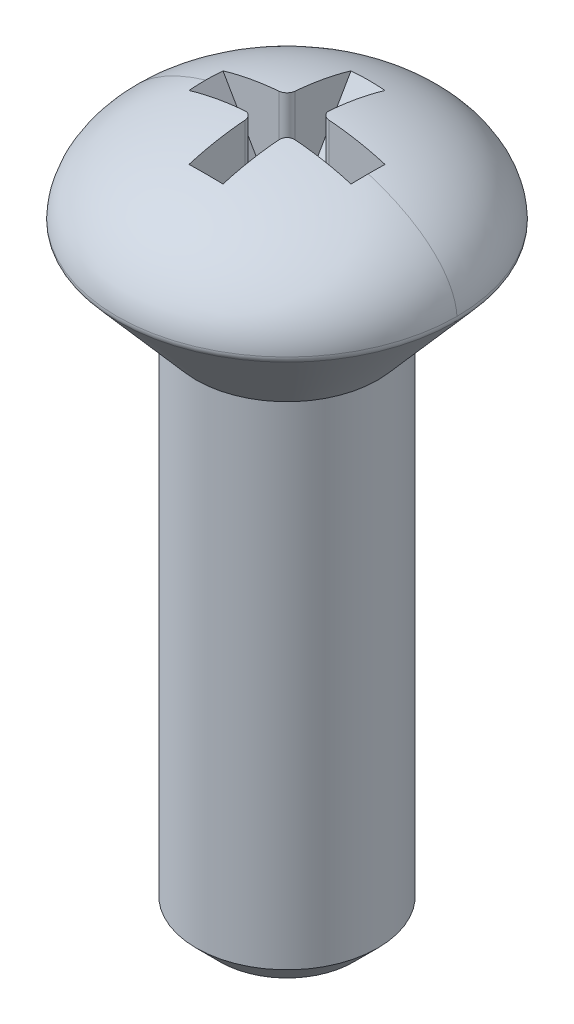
ISO-10303-21;
HEADER;
FILE_DESCRIPTION(('STEP AP214'),'2;1');
FILE_NAME('part.step','',(''),(''),'','','');
FILE_SCHEMA(('AUTOMOTIVE_DESIGN { 1 0 10303 214 1 1 1 1 }'));
ENDSEC;
DATA;
#1=APPLICATION_CONTEXT('core data for automotive mechanical design processes');
#2=APPLICATION_PROTOCOL_DEFINITION('international standard','automotive_design',2000,#1);
#3=PRODUCT_CONTEXT('',#1,'mechanical');
#4=PRODUCT('Part','Part','',(#3));
#5=PRODUCT_RELATED_PRODUCT_CATEGORY('part','',(#4));
#6=PRODUCT_DEFINITION_FORMATION('','',#4);
#7=PRODUCT_DEFINITION_CONTEXT('part definition',#1,'design');
#8=PRODUCT_DEFINITION('design','',#6,#7);
#9=PRODUCT_DEFINITION_SHAPE('','',#8);
#10=(LENGTH_UNIT() NAMED_UNIT(*) SI_UNIT(.MILLI.,.METRE.));
#11=(NAMED_UNIT(*) PLANE_ANGLE_UNIT() SI_UNIT($,.RADIAN.));
#12=(NAMED_UNIT(*) SI_UNIT($,.STERADIAN.) SOLID_ANGLE_UNIT());
#13=UNCERTAINTY_MEASURE_WITH_UNIT(LENGTH_MEASURE(1.E-05),#10,'distance_accuracy_value','');
#14=(GEOMETRIC_REPRESENTATION_CONTEXT(3) GLOBAL_UNCERTAINTY_ASSIGNED_CONTEXT((#13)) GLOBAL_UNIT_ASSIGNED_CONTEXT((#10,
#11,#12)) REPRESENTATION_CONTEXT('',''));
#15=CARTESIAN_POINT('',(0.,0.,0.));
#16=DIRECTION('',(0.,0.,1.));
#17=DIRECTION('',(1.,0.,0.));
#18=AXIS2_PLACEMENT_3D('',#15,#16,#17);
#19=CARTESIAN_POINT('',(0.2667,0.2032,0.2667));
#20=DIRECTION('',(0.,1.,0.));
#21=DIRECTION('',(0.,0.,1.));
#22=AXIS2_PLACEMENT_3D('',#19,#20,#21);
#23=PLANE('',#22);
#24=DIRECTION('',(0.,0.,1.));
#25=VECTOR('',#24,1.);
#26=CARTESIAN_POINT('',(-0.2667,0.2032,1.27));
#27=LINE('',#26,#25);
#28=CARTESIAN_POINT('',(-0.2667,0.2032,0.393700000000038));
#29=VERTEX_POINT('',#28);
#30=CARTESIAN_POINT('',(-0.2667,0.2032,0.644243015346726));
#31=VERTEX_POINT('',#30);
#32=EDGE_CURVE('E182',#29,#31,#27,.T.);
#33=ORIENTED_EDGE('',*,*,#32,.T.);
#34=DIRECTION('',(1.,0.,0.));
#35=VECTOR('',#34,1.);
#36=CARTESIAN_POINT('',(0.,0.2032,0.644243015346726));
#37=LINE('',#36,#35);
#38=CARTESIAN_POINT('',(0.2667,0.2032,0.644243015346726));
#39=VERTEX_POINT('',#38);
#40=EDGE_CURVE('E188',#39,#31,#37,.F.);
#41=ORIENTED_EDGE('',*,*,#40,.F.);
#42=DIRECTION('',(0.,0.,-1.));
#43=VECTOR('',#42,1.);
#44=CARTESIAN_POINT('',(0.2667,0.2032,1.27));
#45=LINE('',#44,#43);
#46=CARTESIAN_POINT('',(0.2667,0.2032,0.3937));
#47=VERTEX_POINT('',#46);
#48=EDGE_CURVE('E193',#39,#47,#45,.T.);
#49=ORIENTED_EDGE('',*,*,#48,.T.);
#50=CARTESIAN_POINT('',(0.3937,0.2032,0.3937));
#51=DIRECTION('',(0.,1.,0.));
#52=DIRECTION('',(0.,0.,1.));
#53=AXIS2_PLACEMENT_3D('',#50,#51,#52);
#54=CIRCLE('',#53,0.127);
#55=CARTESIAN_POINT('',(0.393700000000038,0.2032,0.2667));
#56=VERTEX_POINT('',#55);
#57=EDGE_CURVE('E202',#56,#47,#54,.T.);
#58=ORIENTED_EDGE('',*,*,#57,.F.);
#59=DIRECTION('',(1.,0.,0.));
#60=VECTOR('',#59,1.);
#61=CARTESIAN_POINT('',(1.27,0.2032,0.2667));
#62=LINE('',#61,#60);
#63=CARTESIAN_POINT('',(0.644243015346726,0.2032,0.2667));
#64=VERTEX_POINT('',#63);
#65=EDGE_CURVE('E199',#56,#64,#62,.T.);
#66=ORIENTED_EDGE('',*,*,#65,.T.);
#67=DIRECTION('',(0.,0.,1.));
#68=VECTOR('',#67,1.);
#69=CARTESIAN_POINT('',(0.644243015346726,0.2032,0.));
#70=LINE('',#69,#68);
#71=CARTESIAN_POINT('',(0.644243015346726,0.2032,-0.2667));
#72=VERTEX_POINT('',#71);
#73=EDGE_CURVE('E206',#72,#64,#70,.T.);
#74=ORIENTED_EDGE('',*,*,#73,.F.);
#75=DIRECTION('',(-1.,0.,0.));
#76=VECTOR('',#75,1.);
#77=CARTESIAN_POINT('',(1.27,0.2032,-0.2667));
#78=LINE('',#77,#76);
#79=CARTESIAN_POINT('',(0.3937,0.2032,-0.2667));
#80=VERTEX_POINT('',#79);
#81=EDGE_CURVE('E211',#72,#80,#78,.T.);
#82=ORIENTED_EDGE('',*,*,#81,.T.);
#83=CARTESIAN_POINT('',(0.3937,0.2032,-0.3937));
#84=DIRECTION('',(0.,1.,0.));
#85=DIRECTION('',(0.,0.,1.));
#86=AXIS2_PLACEMENT_3D('',#83,#84,#85);
#87=CIRCLE('',#86,0.127);
#88=CARTESIAN_POINT('',(0.2667,0.2032,-0.393700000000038));
#89=VERTEX_POINT('',#88);
#90=EDGE_CURVE('E219',#89,#80,#87,.T.);
#91=ORIENTED_EDGE('',*,*,#90,.F.);
#92=DIRECTION('',(0.,0.,-1.));
#93=VECTOR('',#92,1.);
#94=CARTESIAN_POINT('',(0.2667,0.2032,-0.2667));
#95=LINE('',#94,#93);
#96=CARTESIAN_POINT('',(0.2667,0.2032,-0.644243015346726));
#97=VERTEX_POINT('',#96);
#98=EDGE_CURVE('E217',#89,#97,#95,.T.);
#99=ORIENTED_EDGE('',*,*,#98,.T.);
#100=DIRECTION('',(1.,0.,0.));
#101=VECTOR('',#100,1.);
#102=CARTESIAN_POINT('',(0.,0.2032,-0.644243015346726));
#103=LINE('',#102,#101);
#104=CARTESIAN_POINT('',(-0.2667,0.2032,-0.644243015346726));
#105=VERTEX_POINT('',#104);
#106=EDGE_CURVE('E143',#105,#97,#103,.T.);
#107=ORIENTED_EDGE('',*,*,#106,.F.);
#108=DIRECTION('',(0.,0.,1.));
#109=VECTOR('',#108,1.);
#110=CARTESIAN_POINT('',(-0.2667,0.2032,-0.2667));
#111=LINE('',#110,#109);
#112=CARTESIAN_POINT('',(-0.2667,0.2032,-0.3937));
#113=VERTEX_POINT('',#112);
#114=EDGE_CURVE('E140',#105,#113,#111,.T.);
#115=ORIENTED_EDGE('',*,*,#114,.T.);
#116=CARTESIAN_POINT('',(-0.3937,0.2032,-0.3937));
#117=DIRECTION('',(0.,1.,0.));
#118=DIRECTION('',(0.,0.,1.));
#119=AXIS2_PLACEMENT_3D('',#116,#117,#118);
#120=CIRCLE('',#119,0.127);
#121=CARTESIAN_POINT('',(-0.393700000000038,0.2032,-0.2667));
#122=VERTEX_POINT('',#121);
#123=EDGE_CURVE('E20',#122,#113,#120,.T.);
#124=ORIENTED_EDGE('',*,*,#123,.F.);
#125=DIRECTION('',(-1.,0.,0.));
#126=VECTOR('',#125,1.);
#127=CARTESIAN_POINT('',(-0.2667,0.2032,-0.2667));
#128=LINE('',#127,#126);
#129=CARTESIAN_POINT('',(-0.644243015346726,0.2032,-0.2667));
#130=VERTEX_POINT('',#129);
#131=EDGE_CURVE('E155',#122,#130,#128,.T.);
#132=ORIENTED_EDGE('',*,*,#131,.T.);
#133=DIRECTION('',(0.,0.,1.));
#134=VECTOR('',#133,1.);
#135=CARTESIAN_POINT('',(-0.644243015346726,0.2032,0.));
#136=LINE('',#135,#134);
#137=CARTESIAN_POINT('',(-0.644243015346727,0.2032,0.2667));
#138=VERTEX_POINT('',#137);
#139=EDGE_CURVE('E169',#138,#130,#136,.F.);
#140=ORIENTED_EDGE('',*,*,#139,.F.);
#141=DIRECTION('',(1.,0.,0.));
#142=VECTOR('',#141,1.);
#143=CARTESIAN_POINT('',(-0.2667,0.2032,0.2667));
#144=LINE('',#143,#142);
#145=CARTESIAN_POINT('',(-0.3937,0.2032,0.2667));
#146=VERTEX_POINT('',#145);
#147=EDGE_CURVE('E176',#138,#146,#144,.T.);
#148=ORIENTED_EDGE('',*,*,#147,.T.);
#149=CARTESIAN_POINT('',(-0.3937,0.2032,0.3937));
#150=DIRECTION('',(0.,1.,0.));
#151=DIRECTION('',(0.,0.,1.));
#152=AXIS2_PLACEMENT_3D('',#149,#150,#151);
#153=CIRCLE('',#152,0.127);
#154=EDGE_CURVE('E184',#29,#146,#153,.T.);
#155=ORIENTED_EDGE('',*,*,#154,.F.);
#156=EDGE_LOOP('',(#33,#41,#49,#58,#66,#74,#82,#91,#99,#107,#115,#124,#132,#140,#148,#155));
#157=FACE_BOUND('',#156,.T.);
#158=ADVANCED_FACE('F17',(#157),#23,.T.);
#159=CARTESIAN_POINT('',(-0.2667,0.2032,-0.2667));
#160=DIRECTION('',(0.,0.,-1.));
#161=DIRECTION('',(-1.,0.,0.));
#162=AXIS2_PLACEMENT_3D('',#159,#160,#161);
#163=PLANE('',#162);
#164=DIRECTION('',(0.,1.,0.));
#165=VECTOR('',#164,1.);
#166=CARTESIAN_POINT('',(-0.393700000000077,0.2032,-0.2667));
#167=LINE('',#166,#165);
#168=CARTESIAN_POINT('',(-0.393700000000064,1.44959332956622,-0.2667));
#169=VERTEX_POINT('',#168);
#170=EDGE_CURVE('E148',#169,#122,#167,.F.);
#171=ORIENTED_EDGE('',*,*,#170,.F.);
#172=CARTESIAN_POINT('',(-1.27,1.28704289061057,-0.2667));
#173=CARTESIAN_POINT('',(-1.22239924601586,1.30137106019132,-0.2667));
#174=CARTESIAN_POINT('',(-1.17451613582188,1.31474655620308,-0.2667));
#175=CARTESIAN_POINT('',(-1.07839618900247,1.33963942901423,-0.2667));
#176=CARTESIAN_POINT('',(-1.03016053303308,1.35116135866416,-0.2667));
#177=CARTESIAN_POINT('',(-0.933363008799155,1.37245294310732,-0.2667));
#178=CARTESIAN_POINT('',(-0.884801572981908,1.38222457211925,-0.266700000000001));
#179=CARTESIAN_POINT('',(-0.787378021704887,1.40009014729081,-0.2667));
#180=CARTESIAN_POINT('',(-0.738515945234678,1.4081843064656,-0.266699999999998));
#181=CARTESIAN_POINT('',(-0.640488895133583,1.42275519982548,-0.266700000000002));
#182=CARTESIAN_POINT('',(-0.591323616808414,1.42922987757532,-0.266700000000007));
#183=CARTESIAN_POINT('',(-0.492693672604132,1.44059767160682,-0.266699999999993));
#184=CARTESIAN_POINT('',(-0.443228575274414,1.44548704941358,-0.266699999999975));
#185=CARTESIAN_POINT('',(-0.393700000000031,1.44959332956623,-0.26669999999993));
#186=B_SPLINE_CURVE_WITH_KNOTS('',3,(#172,#173,#174,#175,#176,#177,#178,#179,#180,#181,#182,
#183,#184,#185),.UNSPECIFIED.,.F.,.F.,(4,2,2,2,2,2,4),(0.,0.149115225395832,0.297858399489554,
0.446432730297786,0.594988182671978,0.74373132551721,0.892822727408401),.UNSPECIFIED.);
#187=CARTESIAN_POINT('',(-1.27,1.28704289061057,-0.2667));
#188=VERTEX_POINT('',#187);
#189=EDGE_CURVE('E273',#188,#169,#186,.T.);
#190=ORIENTED_EDGE('',*,*,#189,.F.);
#191=DIRECTION('',(-0.500000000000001,0.866025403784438,0.));
#192=VECTOR('',#191,1.);
#193=CARTESIAN_POINT('',(-1.27,1.28704289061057,-0.2667));
#194=LINE('',#193,#192);
#195=EDGE_CURVE('E172',#130,#188,#194,.T.);
#196=ORIENTED_EDGE('',*,*,#195,.F.);
#197=ORIENTED_EDGE('',*,*,#131,.F.);
#198=EDGE_LOOP('',(#171,#190,#196,#197));
#199=FACE_BOUND('',#198,.T.);
#200=ADVANCED_FACE('F335',(#199),#163,.F.);
#201=CARTESIAN_POINT('',(-0.3937,0.2032,-0.3937));
#202=DIRECTION('',(0.,1.,0.));
#203=DIRECTION('',(0.,0.,1.));
#204=AXIS2_PLACEMENT_3D('',#201,#202,#203);
#205=CYLINDRICAL_SURFACE('',#204,0.127);
#206=CARTESIAN_POINT('',(-0.393700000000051,1.44959332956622,-0.2667));
#207=CARTESIAN_POINT('',(-0.386583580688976,1.45018303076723,-0.266700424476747));
#208=CARTESIAN_POINT('',(-0.379475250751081,1.45072206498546,-0.267299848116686));
#209=CARTESIAN_POINT('',(-0.365454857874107,1.45168595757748,-0.269675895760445));
#210=CARTESIAN_POINT('',(-0.358542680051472,1.45211088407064,-0.271451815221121));
#211=CARTESIAN_POINT('',(-0.338398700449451,1.45319401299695,-0.278499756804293));
#212=CARTESIAN_POINT('',(-0.325713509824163,1.45366434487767,-0.285492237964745));
#213=CARTESIAN_POINT('',(-0.303428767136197,1.45403955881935,-0.303235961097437));
#214=CARTESIAN_POINT('',(-0.293817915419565,1.45394653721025,-0.313973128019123));
#215=CARTESIAN_POINT('',(-0.278698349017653,1.45321058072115,-0.337997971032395));
#216=CARTESIAN_POINT('',(-0.273183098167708,1.45256852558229,-0.351281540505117));
#217=CARTESIAN_POINT('',(-0.267780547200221,1.4510975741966,-0.374459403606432));
#218=CARTESIAN_POINT('',(-0.266661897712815,1.45039284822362,-0.384089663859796));
#219=CARTESIAN_POINT('',(-0.2667,1.44959332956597,-0.393700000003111));
#220=B_SPLINE_CURVE_WITH_KNOTS('',3,(#206,#207,#208,#209,#210,#211,#212,#213,#214,#215,#216,
#217,#218,#219),.UNSPECIFIED.,.F.,.F.,(4,2,2,2,2,2,4),(0.,0.0213729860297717,0.0427331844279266,
0.0853220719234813,0.127752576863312,0.17011522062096,0.199018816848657),.UNSPECIFIED.);
#221=CARTESIAN_POINT('',(-0.2667,1.44959332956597,-0.393700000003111));
#222=VERTEX_POINT('',#221);
#223=EDGE_CURVE('E311',#169,#222,#220,.T.);
#224=ORIENTED_EDGE('',*,*,#223,.F.);
#225=ORIENTED_EDGE('',*,*,#170,.T.);
#226=ORIENTED_EDGE('',*,*,#123,.T.);
#227=DIRECTION('',(0.,1.,0.));
#228=VECTOR('',#227,1.);
#229=CARTESIAN_POINT('',(-0.2667,0.2032,-0.3937));
#230=LINE('',#229,#228);
#231=EDGE_CURVE('E147',#113,#222,#230,.T.);
#232=ORIENTED_EDGE('',*,*,#231,.T.);
#233=EDGE_LOOP('',(#224,#225,#226,#232));
#234=FACE_BOUND('',#233,.T.);
#235=ADVANCED_FACE('F153',(#234),#205,.T.);
#236=CARTESIAN_POINT('',(-0.2667,0.2032,-0.2667));
#237=DIRECTION('',(-1.,0.,0.));
#238=DIRECTION('',(0.,0.,1.));
#239=AXIS2_PLACEMENT_3D('',#236,#237,#238);
#240=PLANE('',#239);
#241=ORIENTED_EDGE('',*,*,#231,.F.);
#242=ORIENTED_EDGE('',*,*,#114,.F.);
#243=DIRECTION('',(0.,-0.866025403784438,0.500000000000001));
#244=VECTOR('',#243,1.);
#245=CARTESIAN_POINT('',(-0.2667,1.28704289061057,-1.27));
#246=LINE('',#245,#244);
#247=CARTESIAN_POINT('',(-0.2667,1.28704289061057,-1.27));
#248=VERTEX_POINT('',#247);
#249=EDGE_CURVE('E160',#248,#105,#246,.T.);
#250=ORIENTED_EDGE('',*,*,#249,.F.);
#251=CARTESIAN_POINT('',(-0.2667,1.44959332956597,-0.393700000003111));
#252=CARTESIAN_POINT('',(-0.2667,1.44548704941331,-0.443228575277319));
#253=CARTESIAN_POINT('',(-0.2667,1.44059767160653,-0.492693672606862));
#254=CARTESIAN_POINT('',(-0.2667,1.42922987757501,-0.591323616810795));
#255=CARTESIAN_POINT('',(-0.2667,1.42275519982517,-0.640488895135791));
#256=CARTESIAN_POINT('',(-0.2667,1.4081843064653,-0.73851594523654));
#257=CARTESIAN_POINT('',(-0.2667,1.40009014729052,-0.787378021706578));
#258=CARTESIAN_POINT('',(-0.2667,1.38222457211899,-0.884801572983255));
#259=CARTESIAN_POINT('',(-0.2667,1.37245294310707,-0.933363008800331));
#260=CARTESIAN_POINT('',(-0.2667,1.35116135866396,-1.03016053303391));
#261=CARTESIAN_POINT('',(-0.2667,1.33963942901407,-1.07839618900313));
#262=CARTESIAN_POINT('',(-0.2667,1.31474655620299,-1.17451613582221));
#263=CARTESIAN_POINT('',(-0.2667,1.30137106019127,-1.22239924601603));
#264=CARTESIAN_POINT('',(-0.266699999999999,1.28704289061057,-1.27));
#265=B_SPLINE_CURVE_WITH_KNOTS('',3,(#251,#252,#253,#254,#255,#256,#257,#258,#259,#260,#261,
#262,#263,#264),.UNSPECIFIED.,.F.,.F.,(4,2,2,2,2,2,4),(0.,0.149091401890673,0.29783454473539,
0.446389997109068,0.594964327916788,0.743707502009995,0.892822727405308),.UNSPECIFIED.);
#266=EDGE_CURVE('E158',#222,#248,#265,.T.);
#267=ORIENTED_EDGE('',*,*,#266,.F.);
#268=EDGE_LOOP('',(#241,#242,#250,#267));
#269=FACE_BOUND('',#268,.T.);
#270=ADVANCED_FACE('F156',(#269),#240,.F.);
#271=CARTESIAN_POINT('',(0.,1.28704289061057,-1.27));
#272=DIRECTION('',(0.,0.500000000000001,0.866025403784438));
#273=DIRECTION('',(0.,-0.866025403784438,0.500000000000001));
#274=AXIS2_PLACEMENT_3D('',#271,#272,#273);
#275=PLANE('',#274);
#276=ORIENTED_EDGE('',*,*,#106,.T.);
#277=DIRECTION('',(0.,0.866025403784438,-0.500000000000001));
#278=VECTOR('',#277,1.);
#279=CARTESIAN_POINT('',(0.2667,0.2032,-0.644243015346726));
#280=LINE('',#279,#278);
#281=CARTESIAN_POINT('',(0.2667,1.28704289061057,-1.27));
#282=VERTEX_POINT('',#281);
#283=EDGE_CURVE('E220',#97,#282,#280,.T.);
#284=ORIENTED_EDGE('',*,*,#283,.T.);
#285=CARTESIAN_POINT('',(-0.2667,1.28704289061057,-1.27));
#286=CARTESIAN_POINT('',(-0.177799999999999,1.29181895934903,-1.27275746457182));
#287=CARTESIAN_POINT('',(-0.088899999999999,1.29420699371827,-1.27413619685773));
#288=CARTESIAN_POINT('',(0.0889000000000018,1.29420699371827,-1.27413619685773));
#289=CARTESIAN_POINT('',(0.177800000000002,1.29181895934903,-1.27275746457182));
#290=CARTESIAN_POINT('',(0.266700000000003,1.28704289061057,-1.27));
#291=B_SPLINE_CURVE_WITH_KNOTS('',3,(#285,#286,#287,#288,#289,#290),.UNSPECIFIED.,.F.,.F.,(4,2,
4),(0.,0.266828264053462,0.533656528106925),.UNSPECIFIED.);
#292=EDGE_CURVE('E301',#248,#282,#291,.T.);
#293=ORIENTED_EDGE('',*,*,#292,.F.);
#294=ORIENTED_EDGE('',*,*,#249,.T.);
#295=EDGE_LOOP('',(#276,#284,#293,#294));
#296=FACE_BOUND('',#295,.T.);
#297=ADVANCED_FACE('F299',(#296),#275,.T.);
#298=CARTESIAN_POINT('',(0.2667,0.2032,-0.2667));
#299=DIRECTION('',(1.,0.,0.));
#300=DIRECTION('',(0.,0.,-1.));
#301=AXIS2_PLACEMENT_3D('',#298,#299,#300);
#302=PLANE('',#301);
#303=DIRECTION('',(0.,1.,0.));
#304=VECTOR('',#303,1.);
#305=CARTESIAN_POINT('',(0.2667,0.2032,-0.393700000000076));
#306=LINE('',#305,#304);
#307=CARTESIAN_POINT('',(0.2667,1.44959332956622,-0.393700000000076));
#308=VERTEX_POINT('',#307);
#309=EDGE_CURVE('E214',#308,#89,#306,.F.);
#310=ORIENTED_EDGE('',*,*,#309,.F.);
#311=CARTESIAN_POINT('',(0.2667,1.28704289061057,-1.27));
#312=CARTESIAN_POINT('',(0.2667,1.30137106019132,-1.22239924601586));
#313=CARTESIAN_POINT('',(0.2667,1.31474655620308,-1.17451613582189));
#314=CARTESIAN_POINT('',(0.2667,1.33963942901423,-1.07839618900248));
#315=CARTESIAN_POINT('',(0.2667,1.35116135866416,-1.0301605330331));
#316=CARTESIAN_POINT('',(0.2667,1.37245294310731,-0.933363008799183));
#317=CARTESIAN_POINT('',(0.266700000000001,1.38222457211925,-0.88480157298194));
#318=CARTESIAN_POINT('',(0.266699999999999,1.40009014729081,-0.787378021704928));
#319=CARTESIAN_POINT('',(0.266699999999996,1.4081843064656,-0.738515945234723));
#320=CARTESIAN_POINT('',(0.266700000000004,1.42275519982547,-0.640488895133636));
#321=CARTESIAN_POINT('',(0.266700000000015,1.42922987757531,-0.591323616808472));
#322=CARTESIAN_POINT('',(0.266699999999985,1.44059767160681,-0.492693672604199));
#323=CARTESIAN_POINT('',(0.266699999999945,1.44548704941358,-0.443228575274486));
#324=CARTESIAN_POINT('',(0.266699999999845,1.44959332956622,-0.393700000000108));
#325=B_SPLINE_CURVE_WITH_KNOTS('',3,(#311,#312,#313,#314,#315,#316,#317,#318,#319,#320,#321,
#322,#323,#324),.UNSPECIFIED.,.F.,.F.,(4,2,2,2,2,2,4),(0.,0.149115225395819,0.297858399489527,
0.446432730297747,0.594988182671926,0.743731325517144,0.892822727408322),.UNSPECIFIED.);
#326=EDGE_CURVE('E305',#282,#308,#325,.T.);
#327=ORIENTED_EDGE('',*,*,#326,.F.);
#328=ORIENTED_EDGE('',*,*,#283,.F.);
#329=ORIENTED_EDGE('',*,*,#98,.F.);
#330=EDGE_LOOP('',(#310,#327,#328,#329));
#331=FACE_BOUND('',#330,.T.);
#332=ADVANCED_FACE('F306',(#331),#302,.F.);
#333=CARTESIAN_POINT('',(0.3937,0.2032,-0.3937));
#334=DIRECTION('',(0.,1.,0.));
#335=DIRECTION('',(0.,0.,1.));
#336=AXIS2_PLACEMENT_3D('',#333,#334,#335);
#337=CYLINDRICAL_SURFACE('',#336,0.127);
#338=CARTESIAN_POINT('',(0.2667,1.44959332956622,-0.393700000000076));
#339=CARTESIAN_POINT('',(0.266700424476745,1.45018303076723,-0.386583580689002));
#340=CARTESIAN_POINT('',(0.267299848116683,1.45072206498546,-0.37947525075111));
#341=CARTESIAN_POINT('',(0.269675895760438,1.45168595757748,-0.365454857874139));
#342=CARTESIAN_POINT('',(0.271451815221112,1.45211088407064,-0.358542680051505));
#343=CARTESIAN_POINT('',(0.278499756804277,1.45319401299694,-0.338398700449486));
#344=CARTESIAN_POINT('',(0.285492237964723,1.45366434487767,-0.325713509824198));
#345=CARTESIAN_POINT('',(0.303235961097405,1.45403955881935,-0.303428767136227));
#346=CARTESIAN_POINT('',(0.313973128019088,1.45394653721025,-0.293817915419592));
#347=CARTESIAN_POINT('',(0.337997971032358,1.45321058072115,-0.278698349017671));
#348=CARTESIAN_POINT('',(0.351281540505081,1.45256852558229,-0.273183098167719));
#349=CARTESIAN_POINT('',(0.374459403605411,1.45109757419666,-0.267780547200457));
#350=CARTESIAN_POINT('',(0.384089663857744,1.45039284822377,-0.266661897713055));
#351=CARTESIAN_POINT('',(0.393700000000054,1.44959332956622,-0.2667));
#352=B_SPLINE_CURVE_WITH_KNOTS('',3,(#338,#339,#340,#341,#342,#343,#344,#345,#346,#347,#348,
#349,#350,#351),.UNSPECIFIED.,.F.,.F.,(4,2,2,2,2,2,4),(0.,0.0213729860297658,0.0427331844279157,
0.0853220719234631,0.127752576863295,0.170115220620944,0.199018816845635),.UNSPECIFIED.);
#353=CARTESIAN_POINT('',(0.393700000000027,1.44959332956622,-0.2667));
#354=VERTEX_POINT('',#353);
#355=EDGE_CURVE('E308',#308,#354,#352,.T.);
#356=ORIENTED_EDGE('',*,*,#355,.F.);
#357=ORIENTED_EDGE('',*,*,#309,.T.);
#358=ORIENTED_EDGE('',*,*,#90,.T.);
#359=DIRECTION('',(0.,1.,0.));
#360=VECTOR('',#359,1.);
#361=CARTESIAN_POINT('',(0.3937,0.2032,-0.2667));
#362=LINE('',#361,#360);
#363=EDGE_CURVE('E213',#80,#354,#362,.T.);
#364=ORIENTED_EDGE('',*,*,#363,.T.);
#365=EDGE_LOOP('',(#356,#357,#358,#364));
#366=FACE_BOUND('',#365,.T.);
#367=ADVANCED_FACE('F481',(#366),#337,.T.);
#368=CARTESIAN_POINT('',(1.27,0.2032,-0.2667));
#369=DIRECTION('',(0.,0.,-1.));
#370=DIRECTION('',(-1.,0.,0.));
#371=AXIS2_PLACEMENT_3D('',#368,#369,#370);
#372=PLANE('',#371);
#373=ORIENTED_EDGE('',*,*,#363,.F.);
#374=ORIENTED_EDGE('',*,*,#81,.F.);
#375=DIRECTION('',(-0.500000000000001,-0.866025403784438,0.));
#376=VECTOR('',#375,1.);
#377=CARTESIAN_POINT('',(1.27,1.28704289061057,-0.2667));
#378=LINE('',#377,#376);
#379=CARTESIAN_POINT('',(1.27,1.28704289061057,-0.2667));
#380=VERTEX_POINT('',#379);
#381=EDGE_CURVE('E208',#380,#72,#378,.T.);
#382=ORIENTED_EDGE('',*,*,#381,.F.);
#383=CARTESIAN_POINT('',(0.393700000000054,1.44959332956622,-0.2667));
#384=CARTESIAN_POINT('',(0.443228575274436,1.44548704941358,-0.2667));
#385=CARTESIAN_POINT('',(0.492693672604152,1.44059767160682,-0.2667));
#386=CARTESIAN_POINT('',(0.591323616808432,1.42922987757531,-0.2667));
#387=CARTESIAN_POINT('',(0.6404888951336,1.42275519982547,-0.2667));
#388=CARTESIAN_POINT('',(0.738515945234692,1.4081843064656,-0.2667));
#389=CARTESIAN_POINT('',(0.7873780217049,1.40009014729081,-0.2667));
#390=CARTESIAN_POINT('',(0.884801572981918,1.38222457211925,-0.2667));
#391=CARTESIAN_POINT('',(0.933363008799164,1.37245294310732,-0.2667));
#392=CARTESIAN_POINT('',(1.03016053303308,1.35116135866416,-0.2667));
#393=CARTESIAN_POINT('',(1.07839618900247,1.33963942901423,-0.2667));
#394=CARTESIAN_POINT('',(1.17451613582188,1.31474655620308,-0.2667));
#395=CARTESIAN_POINT('',(1.22239924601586,1.30137106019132,-0.2667));
#396=CARTESIAN_POINT('',(1.27,1.28704289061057,-0.2667));
#397=B_SPLINE_CURVE_WITH_KNOTS('',3,(#383,#384,#385,#386,#387,#388,#389,#390,#391,#392,#393,
#394,#395,#396),.UNSPECIFIED.,.F.,.F.,(4,2,2,2,2,2,4),(0.,0.149091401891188,0.297834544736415,
0.446389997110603,0.594964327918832,0.74370750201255,0.892822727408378),.UNSPECIFIED.);
#398=EDGE_CURVE('E473',#354,#380,#397,.T.);
#399=ORIENTED_EDGE('',*,*,#398,.F.);
#400=EDGE_LOOP('',(#373,#374,#382,#399));
#401=FACE_BOUND('',#400,.T.);
#402=ADVANCED_FACE('F460',(#401),#372,.F.);
#403=CARTESIAN_POINT('',(1.27,1.28704289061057,0.));
#404=DIRECTION('',(-0.866025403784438,0.500000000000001,0.));
#405=DIRECTION('',(-0.500000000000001,-0.866025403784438,0.));
#406=AXIS2_PLACEMENT_3D('',#403,#404,#405);
#407=PLANE('',#406);
#408=ORIENTED_EDGE('',*,*,#73,.T.);
#409=DIRECTION('',(0.500000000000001,0.866025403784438,0.));
#410=VECTOR('',#409,1.);
#411=CARTESIAN_POINT('',(0.644243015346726,0.2032,0.2667));
#412=LINE('',#411,#410);
#413=CARTESIAN_POINT('',(1.27,1.28704289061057,0.2667));
#414=VERTEX_POINT('',#413);
#415=EDGE_CURVE('E203',#64,#414,#412,.T.);
#416=ORIENTED_EDGE('',*,*,#415,.T.);
#417=CARTESIAN_POINT('',(1.27413619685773,1.29420699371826,0.));
#418=CARTESIAN_POINT('',(1.2741368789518,1.29420817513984,0.044492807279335));
#419=CARTESIAN_POINT('',(1.27379253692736,1.29361175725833,0.0889642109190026));
#420=CARTESIAN_POINT('',(1.27241380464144,1.29122372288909,0.177864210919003));
#421=CARTESIAN_POINT('',(1.27137941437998,1.28943210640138,0.222292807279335));
#422=CARTESIAN_POINT('',(1.27,1.28704289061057,0.2667));
#423=B_SPLINE_CURVE_WITH_KNOTS('',3,(#417,#418,#419,#420,#421,#422),.UNSPECIFIED.,.F.,.F.,(4,2,
4),(0.,0.133430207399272,0.266860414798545),.UNSPECIFIED.);
#424=CARTESIAN_POINT('',(1.27413619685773,1.29420699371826,0.));
#425=VERTEX_POINT('',#424);
#426=EDGE_CURVE('E464',#425,#414,#423,.T.);
#427=ORIENTED_EDGE('',*,*,#426,.F.);
#428=CARTESIAN_POINT('',(1.27,1.28704289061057,-0.2667));
#429=CARTESIAN_POINT('',(1.27137941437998,1.28943210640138,-0.222292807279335));
#430=CARTESIAN_POINT('',(1.27241380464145,1.29122372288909,-0.177864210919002));
#431=CARTESIAN_POINT('',(1.27379253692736,1.29361175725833,-0.088964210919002));
#432=CARTESIAN_POINT('',(1.2741368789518,1.29420817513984,-0.0444928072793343));
#433=CARTESIAN_POINT('',(1.27413619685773,1.29420699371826,0.));
#434=B_SPLINE_CURVE_WITH_KNOTS('',3,(#428,#429,#430,#431,#432,#433),.UNSPECIFIED.,.F.,.F.,(4,2,
4),(0.,0.133430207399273,0.266860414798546),.UNSPECIFIED.);
#435=EDGE_CURVE('E389',#380,#425,#434,.T.);
#436=ORIENTED_EDGE('',*,*,#435,.F.);
#437=ORIENTED_EDGE('',*,*,#381,.T.);
#438=EDGE_LOOP('',(#408,#416,#427,#436,#437));
#439=FACE_BOUND('',#438,.T.);
#440=ADVANCED_FACE('F455',(#439),#407,.T.);
#441=CARTESIAN_POINT('',(1.27,0.2032,0.2667));
#442=DIRECTION('',(0.,0.,1.));
#443=DIRECTION('',(1.,0.,0.));
#444=AXIS2_PLACEMENT_3D('',#441,#442,#443);
#445=PLANE('',#444);
#446=DIRECTION('',(0.,1.,0.));
#447=VECTOR('',#446,1.);
#448=CARTESIAN_POINT('',(0.393700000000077,0.2032,0.2667));
#449=LINE('',#448,#447);
#450=CARTESIAN_POINT('',(0.393700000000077,1.44959332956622,0.2667));
#451=VERTEX_POINT('',#450);
#452=EDGE_CURVE('E196',#451,#56,#449,.F.);
#453=ORIENTED_EDGE('',*,*,#452,.F.);
#454=CARTESIAN_POINT('',(1.27,1.28704289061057,0.2667));
#455=CARTESIAN_POINT('',(1.22239924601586,1.30137106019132,0.2667));
#456=CARTESIAN_POINT('',(1.17451613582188,1.31474655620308,0.2667));
#457=CARTESIAN_POINT('',(1.07839618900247,1.33963942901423,0.2667));
#458=CARTESIAN_POINT('',(1.03016053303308,1.35116135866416,0.2667));
#459=CARTESIAN_POINT('',(0.933363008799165,1.37245294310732,0.2667));
#460=CARTESIAN_POINT('',(0.884801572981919,1.38222457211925,0.2667));
#461=CARTESIAN_POINT('',(0.787378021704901,1.40009014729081,0.266699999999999));
#462=CARTESIAN_POINT('',(0.738515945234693,1.4081843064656,0.266699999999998));
#463=CARTESIAN_POINT('',(0.640488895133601,1.42275519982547,0.266700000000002));
#464=CARTESIAN_POINT('',(0.591323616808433,1.42922987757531,0.266700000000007));
#465=CARTESIAN_POINT('',(0.492693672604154,1.44059767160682,0.266699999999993));
#466=CARTESIAN_POINT('',(0.443228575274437,1.44548704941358,0.266699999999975));
#467=CARTESIAN_POINT('',(0.393700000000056,1.44959332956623,0.26669999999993));
#468=B_SPLINE_CURVE_WITH_KNOTS('',3,(#454,#455,#456,#457,#458,#459,#460,#461,#462,#463,#464,
#465,#466,#467),.UNSPECIFIED.,.F.,.F.,(4,2,2,2,2,2,4),(0.,0.149115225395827,0.297858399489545,
0.446432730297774,0.594988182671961,0.743731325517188,0.892822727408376),.UNSPECIFIED.);
#469=EDGE_CURVE('E441',#414,#451,#468,.T.);
#470=ORIENTED_EDGE('',*,*,#469,.F.);
#471=ORIENTED_EDGE('',*,*,#415,.F.);
#472=ORIENTED_EDGE('',*,*,#65,.F.);
#473=EDGE_LOOP('',(#453,#470,#471,#472));
#474=FACE_BOUND('',#473,.T.);
#475=ADVANCED_FACE('F450',(#474),#445,.F.);
#476=CARTESIAN_POINT('',(0.3937,0.2032,0.3937));
#477=DIRECTION('',(0.,1.,0.));
#478=DIRECTION('',(0.,0.,1.));
#479=AXIS2_PLACEMENT_3D('',#476,#477,#478);
#480=CYLINDRICAL_SURFACE('',#479,0.127);
#481=CARTESIAN_POINT('',(0.393700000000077,1.44959332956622,0.2667));
#482=CARTESIAN_POINT('',(0.386583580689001,1.45018303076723,0.266700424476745));
#483=CARTESIAN_POINT('',(0.379475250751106,1.45072206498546,0.267299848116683));
#484=CARTESIAN_POINT('',(0.365454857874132,1.45168595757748,0.269675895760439));
#485=CARTESIAN_POINT('',(0.358542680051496,1.45211088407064,0.271451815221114));
#486=CARTESIAN_POINT('',(0.338398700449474,1.45319401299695,0.278499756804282));
#487=CARTESIAN_POINT('',(0.325713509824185,1.45366434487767,0.285492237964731));
#488=CARTESIAN_POINT('',(0.303428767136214,1.45403955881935,0.303235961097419));
#489=CARTESIAN_POINT('',(0.293817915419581,1.45394653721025,0.313973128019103));
#490=CARTESIAN_POINT('',(0.278698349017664,1.45321058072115,0.337997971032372));
#491=CARTESIAN_POINT('',(0.273183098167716,1.45256852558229,0.351281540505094));
#492=CARTESIAN_POINT('',(0.267780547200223,1.4510975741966,0.374459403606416));
#493=CARTESIAN_POINT('',(0.266661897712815,1.45039284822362,0.384089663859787));
#494=CARTESIAN_POINT('',(0.2667,1.44959332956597,0.393700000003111));
#495=B_SPLINE_CURVE_WITH_KNOTS('',3,(#481,#482,#483,#484,#485,#486,#487,#488,#489,#490,#491,
#492,#493,#494),.UNSPECIFIED.,.F.,.F.,(4,2,2,2,2,2,4),(0.,0.0213729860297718,0.0427331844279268,
0.0853220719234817,0.127752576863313,0.170115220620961,0.199018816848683),.UNSPECIFIED.);
#496=CARTESIAN_POINT('',(0.2667,1.44959332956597,0.393700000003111));
#497=VERTEX_POINT('',#496);
#498=EDGE_CURVE('E435',#451,#497,#495,.T.);
#499=ORIENTED_EDGE('',*,*,#498,.F.);
#500=ORIENTED_EDGE('',*,*,#452,.T.);
#501=ORIENTED_EDGE('',*,*,#57,.T.);
#502=DIRECTION('',(0.,1.,0.));
#503=VECTOR('',#502,1.);
#504=CARTESIAN_POINT('',(0.2667,0.2032,0.3937));
#505=LINE('',#504,#503);
#506=EDGE_CURVE('E195',#47,#497,#505,.T.);
#507=ORIENTED_EDGE('',*,*,#506,.T.);
#508=EDGE_LOOP('',(#499,#500,#501,#507));
#509=FACE_BOUND('',#508,.T.);
#510=ADVANCED_FACE('F447',(#509),#480,.T.);
#511=CARTESIAN_POINT('',(0.2667,0.2032,1.27));
#512=DIRECTION('',(1.,0.,0.));
#513=DIRECTION('',(0.,0.,-1.));
#514=AXIS2_PLACEMENT_3D('',#511,#512,#513);
#515=PLANE('',#514);
#516=ORIENTED_EDGE('',*,*,#506,.F.);
#517=ORIENTED_EDGE('',*,*,#48,.F.);
#518=DIRECTION('',(0.,0.866025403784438,0.500000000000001));
#519=VECTOR('',#518,1.);
#520=CARTESIAN_POINT('',(0.266700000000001,1.28704289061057,1.27));
#521=LINE('',#520,#519);
#522=CARTESIAN_POINT('',(0.2667,1.28704289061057,1.27));
#523=VERTEX_POINT('',#522);
#524=EDGE_CURVE('E190',#523,#39,#521,.F.);
#525=ORIENTED_EDGE('',*,*,#524,.F.);
#526=CARTESIAN_POINT('',(0.2667,1.44959332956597,0.393700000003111));
#527=CARTESIAN_POINT('',(0.2667,1.44548704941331,0.443228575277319));
#528=CARTESIAN_POINT('',(0.2667,1.44059767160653,0.492693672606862));
#529=CARTESIAN_POINT('',(0.2667,1.42922987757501,0.591323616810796));
#530=CARTESIAN_POINT('',(0.2667,1.42275519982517,0.640488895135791));
#531=CARTESIAN_POINT('',(0.2667,1.4081843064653,0.738515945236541));
#532=CARTESIAN_POINT('',(0.2667,1.40009014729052,0.787378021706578));
#533=CARTESIAN_POINT('',(0.2667,1.38222457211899,0.884801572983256));
#534=CARTESIAN_POINT('',(0.2667,1.37245294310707,0.933363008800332));
#535=CARTESIAN_POINT('',(0.2667,1.35116135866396,1.03016053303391));
#536=CARTESIAN_POINT('',(0.2667,1.33963942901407,1.07839618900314));
#537=CARTESIAN_POINT('',(0.2667,1.31474655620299,1.17451613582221));
#538=CARTESIAN_POINT('',(0.2667,1.30137106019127,1.22239924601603));
#539=CARTESIAN_POINT('',(0.266699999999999,1.28704289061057,1.27));
#540=B_SPLINE_CURVE_WITH_KNOTS('',3,(#526,#527,#528,#529,#530,#531,#532,#533,#534,#535,#536,
#537,#538,#539),.UNSPECIFIED.,.F.,.F.,(4,2,2,2,2,2,4),(0.,0.149091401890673,0.29783454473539,
0.446389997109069,0.594964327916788,0.743707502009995,0.892822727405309),.UNSPECIFIED.);
#541=EDGE_CURVE('E429',#497,#523,#540,.T.);
#542=ORIENTED_EDGE('',*,*,#541,.F.);
#543=EDGE_LOOP('',(#516,#517,#525,#542));
#544=FACE_BOUND('',#543,.T.);
#545=ADVANCED_FACE('F420',(#544),#515,.F.);
#546=CARTESIAN_POINT('',(0.,1.28704289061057,1.27));
#547=DIRECTION('',(0.,0.500000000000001,-0.866025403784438));
#548=DIRECTION('',(0.,0.866025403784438,0.500000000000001));
#549=AXIS2_PLACEMENT_3D('',#546,#547,#548);
#550=PLANE('',#549);
#551=ORIENTED_EDGE('',*,*,#40,.T.);
#552=DIRECTION('',(0.,0.866025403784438,0.500000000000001));
#553=VECTOR('',#552,1.);
#554=CARTESIAN_POINT('',(-0.2667,0.2032,0.644243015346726));
#555=LINE('',#554,#553);
#556=CARTESIAN_POINT('',(-0.2667,1.28704289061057,1.27));
#557=VERTEX_POINT('',#556);
#558=EDGE_CURVE('E185',#31,#557,#555,.T.);
#559=ORIENTED_EDGE('',*,*,#558,.T.);
#560=CARTESIAN_POINT('',(0.2667,1.28704289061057,1.27));
#561=CARTESIAN_POINT('',(0.1778,1.29181895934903,1.27275746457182));
#562=CARTESIAN_POINT('',(0.0888999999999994,1.29420699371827,1.27413619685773));
#563=CARTESIAN_POINT('',(-0.0889000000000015,1.29420699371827,1.27413619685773));
#564=CARTESIAN_POINT('',(-0.177800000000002,1.29181895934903,1.27275746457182));
#565=CARTESIAN_POINT('',(-0.266700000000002,1.28704289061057,1.27));
#566=B_SPLINE_CURVE_WITH_KNOTS('',3,(#560,#561,#562,#563,#564,#565),.UNSPECIFIED.,.F.,.F.,(4,2,
4),(0.,0.266828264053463,0.533656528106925),.UNSPECIFIED.);
#567=EDGE_CURVE('E397',#523,#557,#566,.T.);
#568=ORIENTED_EDGE('',*,*,#567,.F.);
#569=ORIENTED_EDGE('',*,*,#524,.T.);
#570=EDGE_LOOP('',(#551,#559,#568,#569));
#571=FACE_BOUND('',#570,.T.);
#572=ADVANCED_FACE('F415',(#571),#550,.T.);
#573=CARTESIAN_POINT('',(-0.2667,0.2032,1.27));
#574=DIRECTION('',(-1.,0.,0.));
#575=DIRECTION('',(0.,0.,1.));
#576=AXIS2_PLACEMENT_3D('',#573,#574,#575);
#577=PLANE('',#576);
#578=DIRECTION('',(0.,1.,0.));
#579=VECTOR('',#578,1.);
#580=CARTESIAN_POINT('',(-0.2667,0.2032,0.393700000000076));
#581=LINE('',#580,#579);
#582=CARTESIAN_POINT('',(-0.2667,1.44959332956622,0.393700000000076));
#583=VERTEX_POINT('',#582);
#584=EDGE_CURVE('E179',#583,#29,#581,.F.);
#585=ORIENTED_EDGE('',*,*,#584,.F.);
#586=CARTESIAN_POINT('',(-0.2667,1.28704289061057,1.27));
#587=CARTESIAN_POINT('',(-0.2667,1.30137106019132,1.22239924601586));
#588=CARTESIAN_POINT('',(-0.2667,1.31474655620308,1.17451613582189));
#589=CARTESIAN_POINT('',(-0.2667,1.33963942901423,1.07839618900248));
#590=CARTESIAN_POINT('',(-0.2667,1.35116135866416,1.0301605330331));
#591=CARTESIAN_POINT('',(-0.2667,1.37245294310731,0.933363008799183));
#592=CARTESIAN_POINT('',(-0.266700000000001,1.38222457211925,0.88480157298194));
#593=CARTESIAN_POINT('',(-0.266699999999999,1.40009014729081,0.787378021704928));
#594=CARTESIAN_POINT('',(-0.266699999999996,1.4081843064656,0.738515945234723));
#595=CARTESIAN_POINT('',(-0.266700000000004,1.42275519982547,0.640488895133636));
#596=CARTESIAN_POINT('',(-0.266700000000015,1.42922987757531,0.591323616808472));
#597=CARTESIAN_POINT('',(-0.266699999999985,1.44059767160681,0.492693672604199));
#598=CARTESIAN_POINT('',(-0.266699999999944,1.44548704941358,0.443228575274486));
#599=CARTESIAN_POINT('',(-0.266699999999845,1.44959332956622,0.393700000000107));
#600=B_SPLINE_CURVE_WITH_KNOTS('',3,(#586,#587,#588,#589,#590,#591,#592,#593,#594,#595,#596,
#597,#598,#599),.UNSPECIFIED.,.F.,.F.,(4,2,2,2,2,2,4),(0.,0.149115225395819,0.297858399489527,
0.446432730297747,0.594988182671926,0.743731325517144,0.892822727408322),.UNSPECIFIED.);
#601=EDGE_CURVE('E396',#557,#583,#600,.T.);
#602=ORIENTED_EDGE('',*,*,#601,.F.);
#603=ORIENTED_EDGE('',*,*,#558,.F.);
#604=ORIENTED_EDGE('',*,*,#32,.F.);
#605=EDGE_LOOP('',(#585,#602,#603,#604));
#606=FACE_BOUND('',#605,.T.);
#607=ADVANCED_FACE('F410',(#606),#577,.F.);
#608=CARTESIAN_POINT('',(-0.3937,0.2032,0.3937));
#609=DIRECTION('',(0.,1.,0.));
#610=DIRECTION('',(0.,0.,1.));
#611=AXIS2_PLACEMENT_3D('',#608,#609,#610);
#612=CYLINDRICAL_SURFACE('',#611,0.127);
#613=CARTESIAN_POINT('',(-0.2667,1.44959332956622,0.393700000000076));
#614=CARTESIAN_POINT('',(-0.266700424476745,1.45018303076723,0.386583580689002));
#615=CARTESIAN_POINT('',(-0.267299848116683,1.45072206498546,0.37947525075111));
#616=CARTESIAN_POINT('',(-0.269675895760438,1.45168595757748,0.365454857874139));
#617=CARTESIAN_POINT('',(-0.271451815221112,1.45211088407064,0.358542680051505));
#618=CARTESIAN_POINT('',(-0.278499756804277,1.45319401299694,0.338398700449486));
#619=CARTESIAN_POINT('',(-0.285492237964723,1.45366434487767,0.325713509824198));
#620=CARTESIAN_POINT('',(-0.303235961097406,1.45403955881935,0.303428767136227));
#621=CARTESIAN_POINT('',(-0.313973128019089,1.45394653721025,0.293817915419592));
#622=CARTESIAN_POINT('',(-0.337997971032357,1.45321058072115,0.278698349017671));
#623=CARTESIAN_POINT('',(-0.351281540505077,1.45256852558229,0.273183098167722));
#624=CARTESIAN_POINT('',(-0.374459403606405,1.4510975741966,0.267780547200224));
#625=CARTESIAN_POINT('',(-0.384089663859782,1.45039284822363,0.266661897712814));
#626=CARTESIAN_POINT('',(-0.393700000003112,1.44959332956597,0.2667));
#627=B_SPLINE_CURVE_WITH_KNOTS('',3,(#613,#614,#615,#616,#617,#618,#619,#620,#621,#622,#623,
#624,#625,#626),.UNSPECIFIED.,.F.,.F.,(4,2,2,2,2,2,4),(0.,0.0213729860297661,0.0427331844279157,
0.085322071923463,0.127752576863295,0.170115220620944,0.199018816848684),.UNSPECIFIED.);
#628=CARTESIAN_POINT('',(-0.393700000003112,1.44959332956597,0.2667));
#629=VERTEX_POINT('',#628);
#630=EDGE_CURVE('E394',#583,#629,#627,.T.);
#631=ORIENTED_EDGE('',*,*,#630,.F.);
#632=ORIENTED_EDGE('',*,*,#584,.T.);
#633=ORIENTED_EDGE('',*,*,#154,.T.);
#634=DIRECTION('',(0.,1.,0.));
#635=VECTOR('',#634,1.);
#636=CARTESIAN_POINT('',(-0.3937,0.2032,0.2667));
#637=LINE('',#636,#635);
#638=EDGE_CURVE('E178',#146,#629,#637,.T.);
#639=ORIENTED_EDGE('',*,*,#638,.T.);
#640=EDGE_LOOP('',(#631,#632,#633,#639));
#641=FACE_BOUND('',#640,.T.);
#642=ADVANCED_FACE('F407',(#641),#612,.T.);
#643=CARTESIAN_POINT('',(-0.2667,0.2032,0.2667));
#644=DIRECTION('',(0.,0.,1.));
#645=DIRECTION('',(1.,0.,0.));
#646=AXIS2_PLACEMENT_3D('',#643,#644,#645);
#647=PLANE('',#646);
#648=ORIENTED_EDGE('',*,*,#638,.F.);
#649=ORIENTED_EDGE('',*,*,#147,.F.);
#650=DIRECTION('',(-0.500000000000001,0.866025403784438,0.));
#651=VECTOR('',#650,1.);
#652=CARTESIAN_POINT('',(-1.27,1.28704289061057,0.2667));
#653=LINE('',#652,#651);
#654=CARTESIAN_POINT('',(-1.27,1.28704289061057,0.2667));
#655=VERTEX_POINT('',#654);
#656=EDGE_CURVE('E173',#655,#138,#653,.F.);
#657=ORIENTED_EDGE('',*,*,#656,.F.);
#658=CARTESIAN_POINT('',(-0.393700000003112,1.44959332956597,0.2667));
#659=CARTESIAN_POINT('',(-0.44322857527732,1.44548704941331,0.2667));
#660=CARTESIAN_POINT('',(-0.492693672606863,1.44059767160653,0.2667));
#661=CARTESIAN_POINT('',(-0.591323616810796,1.42922987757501,0.2667));
#662=CARTESIAN_POINT('',(-0.640488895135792,1.42275519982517,0.2667));
#663=CARTESIAN_POINT('',(-0.738515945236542,1.4081843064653,0.2667));
#664=CARTESIAN_POINT('',(-0.787378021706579,1.40009014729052,0.2667));
#665=CARTESIAN_POINT('',(-0.884801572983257,1.38222457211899,0.2667));
#666=CARTESIAN_POINT('',(-0.933363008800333,1.37245294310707,0.2667));
#667=CARTESIAN_POINT('',(-1.03016053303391,1.35116135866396,0.2667));
#668=CARTESIAN_POINT('',(-1.07839618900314,1.33963942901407,0.2667));
#669=CARTESIAN_POINT('',(-1.17451613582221,1.31474655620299,0.2667));
#670=CARTESIAN_POINT('',(-1.22239924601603,1.30137106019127,0.2667));
#671=CARTESIAN_POINT('',(-1.27,1.28704289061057,0.2667));
#672=B_SPLINE_CURVE_WITH_KNOTS('',3,(#658,#659,#660,#661,#662,#663,#664,#665,#666,#667,#668,
#669,#670,#671),.UNSPECIFIED.,.F.,.F.,(4,2,2,2,2,2,4),(0.,0.149091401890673,0.29783454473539,
0.446389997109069,0.594964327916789,0.743707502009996,0.89282272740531),.UNSPECIFIED.);
#673=EDGE_CURVE('E241',#629,#655,#672,.T.);
#674=ORIENTED_EDGE('',*,*,#673,.F.);
#675=EDGE_LOOP('',(#648,#649,#657,#674));
#676=FACE_BOUND('',#675,.T.);
#677=ADVANCED_FACE('F257',(#676),#647,.F.);
#678=CARTESIAN_POINT('',(-1.27,1.28704289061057,0.));
#679=DIRECTION('',(0.866025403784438,0.500000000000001,0.));
#680=DIRECTION('',(-0.500000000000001,0.866025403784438,0.));
#681=AXIS2_PLACEMENT_3D('',#678,#679,#680);
#682=PLANE('',#681);
#683=ORIENTED_EDGE('',*,*,#139,.T.);
#684=ORIENTED_EDGE('',*,*,#195,.T.);
#685=CARTESIAN_POINT('',(-1.27413619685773,1.29420699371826,0.));
#686=CARTESIAN_POINT('',(-1.2741368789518,1.29420817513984,-0.0444928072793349));
#687=CARTESIAN_POINT('',(-1.27379253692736,1.29361175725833,-0.0889642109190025));
#688=CARTESIAN_POINT('',(-1.27241380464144,1.29122372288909,-0.177864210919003));
#689=CARTESIAN_POINT('',(-1.27137941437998,1.28943210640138,-0.222292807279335));
#690=CARTESIAN_POINT('',(-1.27,1.28704289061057,-0.2667));
#691=B_SPLINE_CURVE_WITH_KNOTS('',3,(#685,#686,#687,#688,#689,#690),.UNSPECIFIED.,.F.,.F.,(4,2,
4),(0.,0.133430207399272,0.266860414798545),.UNSPECIFIED.);
#692=CARTESIAN_POINT('',(-1.27413619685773,1.29420699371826,0.));
#693=VERTEX_POINT('',#692);
#694=EDGE_CURVE('E266',#693,#188,#691,.T.);
#695=ORIENTED_EDGE('',*,*,#694,.F.);
#696=CARTESIAN_POINT('',(-1.27,1.28704289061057,0.2667));
#697=CARTESIAN_POINT('',(-1.27137941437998,1.28943210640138,0.222292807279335));
#698=CARTESIAN_POINT('',(-1.27241380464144,1.29122372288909,0.177864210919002));
#699=CARTESIAN_POINT('',(-1.27379253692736,1.29361175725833,0.0889642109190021));
#700=CARTESIAN_POINT('',(-1.2741368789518,1.29420817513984,0.0444928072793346));
#701=CARTESIAN_POINT('',(-1.27413619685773,1.29420699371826,0.));
#702=B_SPLINE_CURVE_WITH_KNOTS('',3,(#696,#697,#698,#699,#700,#701),.UNSPECIFIED.,.F.,.F.,(4,2,
4),(0.,0.133430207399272,0.266860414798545),.UNSPECIFIED.);
#703=EDGE_CURVE('E232',#655,#693,#702,.T.);
#704=ORIENTED_EDGE('',*,*,#703,.F.);
#705=ORIENTED_EDGE('',*,*,#656,.T.);
#706=EDGE_LOOP('',(#683,#684,#695,#704,#705));
#707=FACE_BOUND('',#706,.T.);
#708=ADVANCED_FACE('F253',(#707),#682,.T.);
#709=CARTESIAN_POINT('',(-2.66519623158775,0.0541729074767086,0.));
#710=CARTESIAN_POINT('',(-2.66519623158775,0.0541729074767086,-5.3303924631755));
#711=CARTESIAN_POINT('',(2.66519623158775,0.0541729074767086,-5.3303924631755));
#712=CARTESIAN_POINT('',(2.66519623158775,0.0541729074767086,0.));
#713=CARTESIAN_POINT('',(-2.61605689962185,0.791828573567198,0.));
#714=CARTESIAN_POINT('',(-2.61605689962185,0.791828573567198,-5.23211379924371));
#715=CARTESIAN_POINT('',(2.61605689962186,0.791828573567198,-5.23211379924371));
#716=CARTESIAN_POINT('',(2.61605689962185,0.791828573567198,0.));
#717=CARTESIAN_POINT('',(-1.72772793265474,1.34327221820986,0.));
#718=CARTESIAN_POINT('',(-1.72772793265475,1.34327221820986,-3.45545586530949));
#719=CARTESIAN_POINT('',(1.72772793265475,1.34327221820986,-3.45545586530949));
#720=CARTESIAN_POINT('',(1.72772793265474,1.34327221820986,0.));
#721=CARTESIAN_POINT('',(-0.407070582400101,1.45593856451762,0.));
#722=CARTESIAN_POINT('',(-0.407070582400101,1.45593856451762,-0.814141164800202));
#723=CARTESIAN_POINT('',(0.407070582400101,1.45593856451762,-0.814141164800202));
#724=CARTESIAN_POINT('',(0.407070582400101,1.45593856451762,0.));
#725=(BOUNDED_SURFACE() B_SPLINE_SURFACE(3,3,((#709,#710,#711,#712),(#713,#714,#715,#716),(#717,
#718,#719,#720),(#721,#722,#723,#724)),.UNSPECIFIED.,.F.,.F.,
.F.) B_SPLINE_SURFACE_WITH_KNOTS((4,4),(4,4),(0.,1.),(0.,1.),
.UNSPECIFIED.) GEOMETRIC_REPRESENTATION_ITEM() RATIONAL_B_SPLINE_SURFACE(((1.,0.333333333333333,
0.333333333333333,1.),(0.847330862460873,0.282443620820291,0.282443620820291,0.847330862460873),
(0.847330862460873,0.282443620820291,0.282443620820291,0.847330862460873),(1.,0.333333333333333,
0.333333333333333,1.))) REPRESENTATION_ITEM('') SURFACE());
#726=CARTESIAN_POINT('',(2.66519623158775,0.0541729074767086,0.));
#727=CARTESIAN_POINT('',(2.61605689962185,0.791828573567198,0.));
#728=CARTESIAN_POINT('',(1.72772793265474,1.34327221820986,0.));
#729=CARTESIAN_POINT('',(0.407070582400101,1.45593856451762,0.));
#730=(BOUNDED_CURVE() B_SPLINE_CURVE(3,(#726,#727,#728,#729),.UNSPECIFIED.,.F.,
.F.) B_SPLINE_CURVE_WITH_KNOTS((4,4),(0.,1.),
.UNSPECIFIED.) CURVE() GEOMETRIC_REPRESENTATION_ITEM() RATIONAL_B_SPLINE_CURVE((1.,
0.847330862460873,0.847330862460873,1.)) REPRESENTATION_ITEM(''));
#731=CARTESIAN_POINT('',(2.66519623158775,0.0541729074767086,0.));
#732=VERTEX_POINT('',#731);
#733=EDGE_CURVE('E35',#732,#425,#730,.T.);
#734=CARTESIAN_POINT('',(0.,0.0541729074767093,0.));
#735=DIRECTION('',(0.,1.,0.));
#736=DIRECTION('',(0.,0.,1.));
#737=AXIS2_PLACEMENT_3D('',#734,#735,#736);
#738=CIRCLE('',#737,2.66519623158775);
#739=CARTESIAN_POINT('',(-2.66519623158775,0.0541729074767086,0.));
#740=VERTEX_POINT('',#739);
#741=EDGE_CURVE('E240',#740,#732,#738,.F.);
#742=CARTESIAN_POINT('',(-2.66519623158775,0.0541729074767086,0.));
#743=CARTESIAN_POINT('',(-2.61605689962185,0.791828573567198,0.));
#744=CARTESIAN_POINT('',(-1.72772793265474,1.34327221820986,0.));
#745=CARTESIAN_POINT('',(-0.407070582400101,1.45593856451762,0.));
#746=(BOUNDED_CURVE() B_SPLINE_CURVE(3,(#742,#743,#744,#745),.UNSPECIFIED.,.F.,
.F.) B_SPLINE_CURVE_WITH_KNOTS((4,4),(0.,1.),
.UNSPECIFIED.) CURVE() GEOMETRIC_REPRESENTATION_ITEM() RATIONAL_B_SPLINE_CURVE((1.,
0.847330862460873,0.847330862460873,1.)) REPRESENTATION_ITEM(''));
#747=EDGE_CURVE('E387',#693,#740,#746,.F.);
#748=ORIENTED_EDGE('',*,*,#733,.F.);
#749=ORIENTED_EDGE('',*,*,#741,.F.);
#750=ORIENTED_EDGE('',*,*,#747,.F.);
#751=ORIENTED_EDGE('',*,*,#694,.T.);
#752=ORIENTED_EDGE('',*,*,#189,.T.);
#753=ORIENTED_EDGE('',*,*,#223,.T.);
#754=ORIENTED_EDGE('',*,*,#266,.T.);
#755=ORIENTED_EDGE('',*,*,#292,.T.);
#756=ORIENTED_EDGE('',*,*,#326,.T.);
#757=ORIENTED_EDGE('',*,*,#355,.T.);
#758=ORIENTED_EDGE('',*,*,#398,.T.);
#759=ORIENTED_EDGE('',*,*,#435,.T.);
#760=EDGE_LOOP('',(#748,#749,#750,#751,#752,#753,#754,#755,#756,#757,#758,#759));
#761=FACE_BOUND('',#760,.T.);
#762=ADVANCED_FACE('F256',(#761),#725,.T.);
#763=CARTESIAN_POINT('',(2.66519623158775,0.0541729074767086,0.));
#764=CARTESIAN_POINT('',(2.66519623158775,0.0541729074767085,5.3303924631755));
#765=CARTESIAN_POINT('',(-2.66519623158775,0.0541729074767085,5.3303924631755));
#766=CARTESIAN_POINT('',(-2.66519623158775,0.0541729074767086,0.));
#767=CARTESIAN_POINT('',(2.61605689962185,0.791828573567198,0.));
#768=CARTESIAN_POINT('',(2.61605689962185,0.791828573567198,5.23211379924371));
#769=CARTESIAN_POINT('',(-2.61605689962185,0.791828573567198,5.23211379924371));
#770=CARTESIAN_POINT('',(-2.61605689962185,0.791828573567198,0.));
#771=CARTESIAN_POINT('',(1.72772793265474,1.34327221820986,0.));
#772=CARTESIAN_POINT('',(1.72772793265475,1.34327221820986,3.45545586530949));
#773=CARTESIAN_POINT('',(-1.72772793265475,1.34327221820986,3.45545586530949));
#774=CARTESIAN_POINT('',(-1.72772793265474,1.34327221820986,0.));
#775=CARTESIAN_POINT('',(0.407070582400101,1.45593856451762,0.));
#776=CARTESIAN_POINT('',(0.407070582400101,1.45593856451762,0.814141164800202));
#777=CARTESIAN_POINT('',(-0.407070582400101,1.45593856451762,0.814141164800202));
#778=CARTESIAN_POINT('',(-0.407070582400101,1.45593856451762,0.));
#779=(BOUNDED_SURFACE() B_SPLINE_SURFACE(3,3,((#763,#764,#765,#766),(#767,#768,#769,#770),(#771,
#772,#773,#774),(#775,#776,#777,#778)),.UNSPECIFIED.,.F.,.F.,
.F.) B_SPLINE_SURFACE_WITH_KNOTS((4,4),(4,4),(0.,1.),(0.,1.),
.UNSPECIFIED.) GEOMETRIC_REPRESENTATION_ITEM() RATIONAL_B_SPLINE_SURFACE(((1.,0.333333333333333,
0.333333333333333,1.),(0.847330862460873,0.282443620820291,0.282443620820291,0.847330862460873),
(0.847330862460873,0.282443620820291,0.282443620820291,0.847330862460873),(1.,0.333333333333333,
0.333333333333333,1.))) REPRESENTATION_ITEM('') SURFACE());
#780=CARTESIAN_POINT('',(0.,0.0541729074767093,0.));
#781=DIRECTION('',(0.,1.,0.));
#782=DIRECTION('',(0.,0.,1.));
#783=AXIS2_PLACEMENT_3D('',#780,#781,#782);
#784=CIRCLE('',#783,2.66519623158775);
#785=EDGE_CURVE('E378',#732,#740,#784,.F.);
#786=ORIENTED_EDGE('',*,*,#673,.T.);
#787=ORIENTED_EDGE('',*,*,#703,.T.);
#788=ORIENTED_EDGE('',*,*,#747,.T.);
#789=ORIENTED_EDGE('',*,*,#785,.F.);
#790=ORIENTED_EDGE('',*,*,#733,.T.);
#791=ORIENTED_EDGE('',*,*,#426,.T.);
#792=ORIENTED_EDGE('',*,*,#469,.T.);
#793=ORIENTED_EDGE('',*,*,#498,.T.);
#794=ORIENTED_EDGE('',*,*,#541,.T.);
#795=ORIENTED_EDGE('',*,*,#567,.T.);
#796=ORIENTED_EDGE('',*,*,#601,.T.);
#797=ORIENTED_EDGE('',*,*,#630,.T.);
#798=EDGE_LOOP('',(#786,#787,#788,#789,#790,#791,#792,#793,#794,#795,#796,#797));
#799=FACE_BOUND('',#798,.T.);
#800=ADVANCED_FACE('F247',(#799),#779,.T.);
#801=CARTESIAN_POINT('',(0.,0.045731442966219,0.));
#802=DIRECTION('',(0.,1.,0.));
#803=DIRECTION('',(0.,0.,1.));
#804=AXIS2_PLACEMENT_3D('',#801,#802,#803);
#805=TOROIDAL_SURFACE('',#804,2.53847708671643,0.127);
#806=ORIENTED_EDGE('',*,*,#785,.T.);
#807=ORIENTED_EDGE('',*,*,#741,.T.);
#808=EDGE_LOOP('',(#806,#807));
#809=FACE_BOUND('',#808,.T.);
#810=CARTESIAN_POINT('',(0.,-0.0375880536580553,0.));
#811=DIRECTION('',(0.,1.,0.));
#812=DIRECTION('',(0.,0.,1.));
#813=AXIS2_PLACEMENT_3D('',#810,#811,#812);
#814=CIRCLE('',#813,2.63432520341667);
#815=CARTESIAN_POINT('',(0.,-0.0375880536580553,2.63432520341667));
#816=VERTEX_POINT('',#815);
#817=EDGE_CURVE('E231',#816,#816,#814,.F.);
#818=ORIENTED_EDGE('',*,*,#817,.F.);
#819=EDGE_LOOP('',(#818));
#820=FACE_BOUND('',#819,.T.);
#821=ADVANCED_FACE('F384',(#809,#820),#805,.T.);
#822=CARTESIAN_POINT('',(1.4224,-9.525,0.));
#823=DIRECTION('',(0.,-1.,0.));
#824=DIRECTION('',(0.,0.,-1.));
#825=AXIS2_PLACEMENT_3D('',#822,#823,#824);
#826=PLANE('',#825);
#827=CARTESIAN_POINT('',(0.,-9.5250000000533,0.));
#828=DIRECTION('',(0.,1.,0.));
#829=DIRECTION('',(0.,0.,1.));
#830=AXIS2_PLACEMENT_3D('',#827,#828,#829);
#831=CIRCLE('',#830,1.04139999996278);
#832=CARTESIAN_POINT('',(0.,-9.5250000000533,1.04139999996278));
#833=VERTEX_POINT('',#832);
#834=EDGE_CURVE('E228',#833,#833,#831,.T.);
#835=ORIENTED_EDGE('',*,*,#834,.F.);
#836=EDGE_LOOP('',(#835));
#837=FACE_BOUND('',#836,.T.);
#838=ADVANCED_FACE('F505',(#837),#826,.T.);
#839=CARTESIAN_POINT('',(0.,-0.0375880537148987,0.));
#840=DIRECTION('',(0.,1.,0.));
#841=DIRECTION('',(0.,0.,1.));
#842=AXIS2_PLACEMENT_3D('',#839,#840,#841);
#843=CONICAL_SURFACE('',#842,2.63432520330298,0.715584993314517);
#844=ORIENTED_EDGE('',*,*,#817,.T.);
#845=EDGE_LOOP('',(#844));
#846=FACE_BOUND('',#845,.T.);
#847=CARTESIAN_POINT('',(0.,-1.43174851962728,0.));
#848=DIRECTION('',(0.,-1.,0.));
#849=DIRECTION('',(0.,0.,-1.));
#850=AXIS2_PLACEMENT_3D('',#847,#848,#849);
#851=CIRCLE('',#850,1.4224);
#852=CARTESIAN_POINT('',(0.,-1.43174851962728,-1.4224));
#853=VERTEX_POINT('',#852);
#854=EDGE_CURVE('E26',#853,#853,#851,.T.);
#855=ORIENTED_EDGE('',*,*,#854,.F.);
#856=EDGE_LOOP('',(#855));
#857=FACE_BOUND('',#856,.T.);
#858=ADVANCED_FACE('F498',(#846,#857),#843,.T.);
#859=CARTESIAN_POINT('',(0.,-9.14400000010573,0.));
#860=DIRECTION('',(0.,1.,0.));
#861=DIRECTION('',(0.,0.,1.));
#862=AXIS2_PLACEMENT_3D('',#859,#860,#861);
#863=CONICAL_SURFACE('',#862,1.42239999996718,0.785398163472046);
#864=CARTESIAN_POINT('',(0.,-9.144,0.));
#865=DIRECTION('',(0.,-1.,0.));
#866=DIRECTION('',(0.,0.,-1.));
#867=AXIS2_PLACEMENT_3D('',#864,#865,#866);
#868=CIRCLE('',#867,1.4224);
#869=CARTESIAN_POINT('',(0.,-9.144,-1.4224));
#870=VERTEX_POINT('',#869);
#871=EDGE_CURVE('E11',#870,#870,#868,.F.);
#872=ORIENTED_EDGE('',*,*,#871,.F.);
#873=EDGE_LOOP('',(#872));
#874=FACE_BOUND('',#873,.T.);
#875=ORIENTED_EDGE('',*,*,#834,.T.);
#876=EDGE_LOOP('',(#875));
#877=FACE_BOUND('',#876,.T.);
#878=ADVANCED_FACE('F492',(#874,#877),#863,.T.);
#879=CARTESIAN_POINT('',(0.,0.,0.));
#880=DIRECTION('',(0.,-1.,0.));
#881=DIRECTION('',(0.,0.,-1.));
#882=AXIS2_PLACEMENT_3D('',#879,#880,#881);
#883=CYLINDRICAL_SURFACE('',#882,1.4224);
#884=ORIENTED_EDGE('',*,*,#871,.T.);
#885=EDGE_LOOP('',(#884));
#886=FACE_BOUND('',#885,.T.);
#887=ORIENTED_EDGE('',*,*,#854,.T.);
#888=EDGE_LOOP('',(#887));
#889=FACE_BOUND('',#888,.T.);
#890=ADVANCED_FACE('F490',(#886,#889),#883,.T.);
#891=CLOSED_SHELL('',(#158,#200,#235,#270,#297,#332,#367,#402,#440,#475,#510,#545,#572,#607,
#642,#677,#708,#762,#800,#821,#838,#858,#878,#890));
#892=MANIFOLD_SOLID_BREP('B1',#891);
#893=ADVANCED_BREP_SHAPE_REPRESENTATION('',(#18,#892),#14);
#894=SHAPE_DEFINITION_REPRESENTATION(#9,#893);
ENDSEC;
END-ISO-10303-21;
